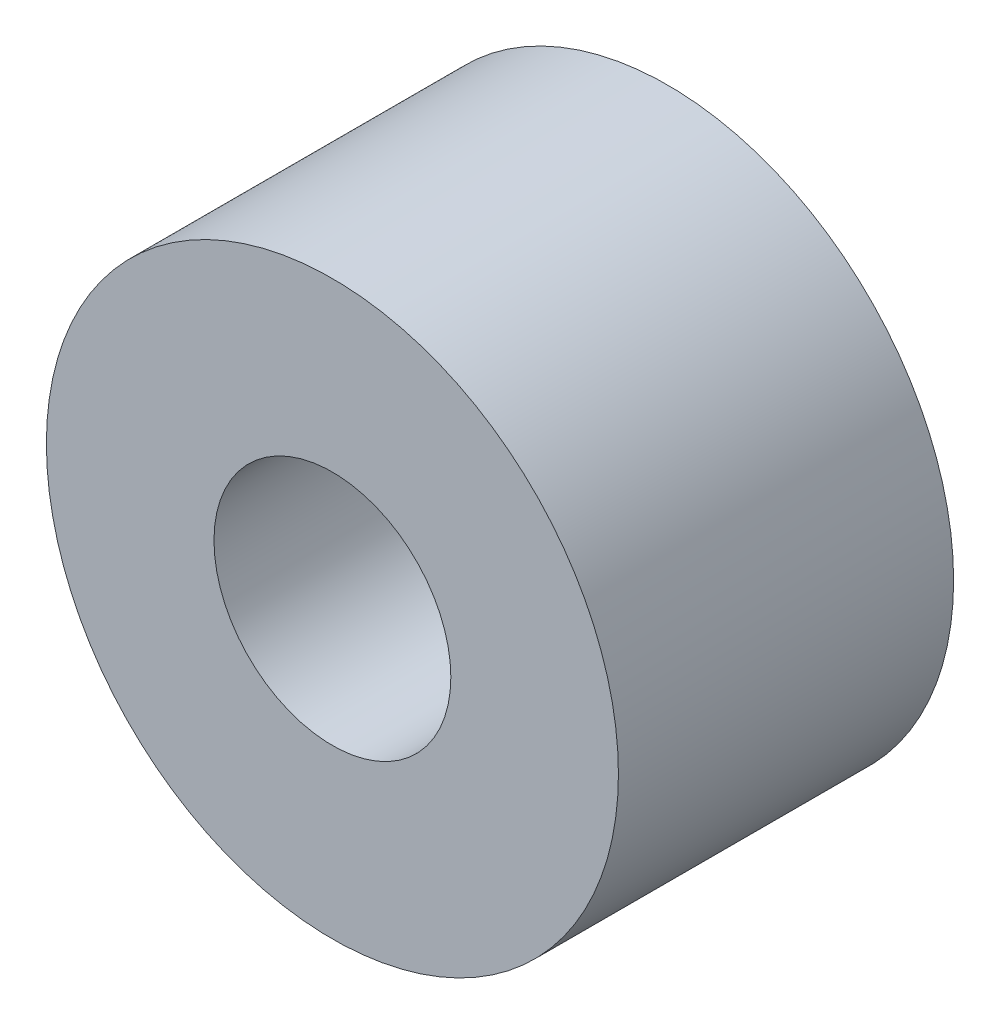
ISO-10303-21;
HEADER;
FILE_DESCRIPTION(('STEP AP214'),'2;1');
FILE_NAME('part.step','',(''),(''),'','','');
FILE_SCHEMA(('AUTOMOTIVE_DESIGN { 1 0 10303 214 1 1 1 1 }'));
ENDSEC;
DATA;
#1=APPLICATION_CONTEXT('core data for automotive mechanical design processes');
#2=APPLICATION_PROTOCOL_DEFINITION('international standard','automotive_design',2000,#1);
#3=PRODUCT_CONTEXT('',#1,'mechanical');
#4=PRODUCT('Part','Part','',(#3));
#5=PRODUCT_RELATED_PRODUCT_CATEGORY('part','',(#4));
#6=PRODUCT_DEFINITION_FORMATION('','',#4);
#7=PRODUCT_DEFINITION_CONTEXT('part definition',#1,'design');
#8=PRODUCT_DEFINITION('design','',#6,#7);
#9=PRODUCT_DEFINITION_SHAPE('','',#8);
#10=(LENGTH_UNIT() NAMED_UNIT(*) SI_UNIT(.MILLI.,.METRE.));
#11=(NAMED_UNIT(*) PLANE_ANGLE_UNIT() SI_UNIT($,.RADIAN.));
#12=(NAMED_UNIT(*) SI_UNIT($,.STERADIAN.) SOLID_ANGLE_UNIT());
#13=UNCERTAINTY_MEASURE_WITH_UNIT(LENGTH_MEASURE(1.E-05),#10,'distance_accuracy_value','');
#14=(GEOMETRIC_REPRESENTATION_CONTEXT(3) GLOBAL_UNCERTAINTY_ASSIGNED_CONTEXT((#13)) GLOBAL_UNIT_ASSIGNED_CONTEXT((#10,
#11,#12)) REPRESENTATION_CONTEXT('',''));
#15=CARTESIAN_POINT('',(0.,0.,0.));
#16=DIRECTION('',(0.,0.,1.));
#17=DIRECTION('',(1.,0.,0.));
#18=AXIS2_PLACEMENT_3D('',#15,#16,#17);
#19=CARTESIAN_POINT('',(-23.7395995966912,12.7425429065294,9.525));
#20=DIRECTION('',(0.,0.,1.));
#21=DIRECTION('',(1.,0.,0.));
#22=AXIS2_PLACEMENT_3D('',#19,#20,#21);
#23=PLANE('',#22);
#24=CARTESIAN_POINT('',(-23.7395995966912,12.7425429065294,9.525));
#25=DIRECTION('',(0.,0.,1.));
#26=DIRECTION('',(1.,0.,0.));
#27=AXIS2_PLACEMENT_3D('',#24,#25,#26);
#28=CIRCLE('',#27,8.128);
#29=CARTESIAN_POINT('',(-31.8675995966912,12.7425429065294,9.525));
#30=VERTEX_POINT('',#29);
#31=EDGE_CURVE('E10',#30,#30,#28,.T.);
#32=ORIENTED_EDGE('',*,*,#31,.T.);
#33=EDGE_LOOP('',(#32));
#34=FACE_BOUND('',#33,.T.);
#35=CARTESIAN_POINT('',(-23.7395995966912,12.7425429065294,9.525));
#36=DIRECTION('',(0.,0.,1.));
#37=DIRECTION('',(1.,0.,0.));
#38=AXIS2_PLACEMENT_3D('',#35,#36,#37);
#39=CIRCLE('',#38,3.3655);
#40=CARTESIAN_POINT('',(-27.1050995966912,12.7425429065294,9.525));
#41=VERTEX_POINT('',#40);
#42=EDGE_CURVE('E42',#41,#41,#39,.T.);
#43=ORIENTED_EDGE('',*,*,#42,.F.);
#44=EDGE_LOOP('',(#43));
#45=FACE_BOUND('',#44,.T.);
#46=ADVANCED_FACE('F31',(#34,#45),#23,.T.);
#47=CARTESIAN_POINT('',(-23.7395995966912,12.7425429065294,0.));
#48=DIRECTION('',(0.,0.,1.));
#49=DIRECTION('',(1.,0.,0.));
#50=AXIS2_PLACEMENT_3D('',#47,#48,#49);
#51=PLANE('',#50);
#52=CARTESIAN_POINT('',(-23.7395995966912,12.7425429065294,0.));
#53=DIRECTION('',(0.,0.,1.));
#54=DIRECTION('',(1.,0.,0.));
#55=AXIS2_PLACEMENT_3D('',#52,#53,#54);
#56=CIRCLE('',#55,8.128);
#57=CARTESIAN_POINT('',(-31.8675995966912,12.7425429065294,0.));
#58=VERTEX_POINT('',#57);
#59=EDGE_CURVE('E35',#58,#58,#56,.T.);
#60=ORIENTED_EDGE('',*,*,#59,.F.);
#61=EDGE_LOOP('',(#60));
#62=FACE_BOUND('',#61,.T.);
#63=CARTESIAN_POINT('',(-23.7395995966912,12.7425429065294,0.));
#64=DIRECTION('',(0.,0.,1.));
#65=DIRECTION('',(1.,0.,0.));
#66=AXIS2_PLACEMENT_3D('',#63,#64,#65);
#67=CIRCLE('',#66,3.3655);
#68=CARTESIAN_POINT('',(-27.1050995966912,12.7425429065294,0.));
#69=VERTEX_POINT('',#68);
#70=EDGE_CURVE('E44',#69,#69,#67,.T.);
#71=ORIENTED_EDGE('',*,*,#70,.T.);
#72=EDGE_LOOP('',(#71));
#73=FACE_BOUND('',#72,.T.);
#74=ADVANCED_FACE('F54',(#62,#73),#51,.F.);
#75=CARTESIAN_POINT('',(-23.7395995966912,12.7425429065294,9.525));
#76=DIRECTION('',(0.,0.,-1.));
#77=DIRECTION('',(-1.,0.,0.));
#78=AXIS2_PLACEMENT_3D('',#75,#76,#77);
#79=CYLINDRICAL_SURFACE('',#78,8.128);
#80=CARTESIAN_POINT('',(-31.8675995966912,12.7425429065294,9.525));
#81=CARTESIAN_POINT('',(-31.8675995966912,12.7425429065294,9.42578125));
#82=CARTESIAN_POINT('',(-31.8675995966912,12.7425429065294,9.3265625));
#83=CARTESIAN_POINT('',(-31.8675995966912,12.7425429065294,9.128125));
#84=CARTESIAN_POINT('',(-31.8675995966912,12.7425429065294,9.02890625));
#85=CARTESIAN_POINT('',(-31.8675995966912,12.7425429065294,8.83046875));
#86=CARTESIAN_POINT('',(-31.8675995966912,12.7425429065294,8.73125));
#87=CARTESIAN_POINT('',(-31.8675995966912,12.7425429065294,8.5328125));
#88=CARTESIAN_POINT('',(-31.8675995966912,12.7425429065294,8.43359375));
#89=CARTESIAN_POINT('',(-31.8675995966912,12.7425429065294,8.23515625));
#90=CARTESIAN_POINT('',(-31.8675995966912,12.7425429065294,8.1359375));
#91=CARTESIAN_POINT('',(-31.8675995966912,12.7425429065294,7.9375));
#92=CARTESIAN_POINT('',(-31.8675995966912,12.7425429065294,7.83828125));
#93=CARTESIAN_POINT('',(-31.8675995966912,12.7425429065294,7.63984375));
#94=CARTESIAN_POINT('',(-31.8675995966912,12.7425429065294,7.540625));
#95=CARTESIAN_POINT('',(-31.8675995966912,12.7425429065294,7.3421875));
#96=CARTESIAN_POINT('',(-31.8675995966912,12.7425429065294,7.24296875));
#97=CARTESIAN_POINT('',(-31.8675995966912,12.7425429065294,7.04453125));
#98=CARTESIAN_POINT('',(-31.8675995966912,12.7425429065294,6.9453125));
#99=CARTESIAN_POINT('',(-31.8675995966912,12.7425429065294,6.746875));
#100=CARTESIAN_POINT('',(-31.8675995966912,12.7425429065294,6.64765625));
#101=CARTESIAN_POINT('',(-31.8675995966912,12.7425429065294,6.44921875));
#102=CARTESIAN_POINT('',(-31.8675995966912,12.7425429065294,6.35));
#103=CARTESIAN_POINT('',(-31.8675995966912,12.7425429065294,6.1515625));
#104=CARTESIAN_POINT('',(-31.8675995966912,12.7425429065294,6.05234375));
#105=CARTESIAN_POINT('',(-31.8675995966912,12.7425429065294,5.85390625));
#106=CARTESIAN_POINT('',(-31.8675995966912,12.7425429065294,5.7546875));
#107=CARTESIAN_POINT('',(-31.8675995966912,12.7425429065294,5.55625));
#108=CARTESIAN_POINT('',(-31.8675995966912,12.7425429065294,5.45703125));
#109=CARTESIAN_POINT('',(-31.8675995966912,12.7425429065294,5.25859375));
#110=CARTESIAN_POINT('',(-31.8675995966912,12.7425429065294,5.159375));
#111=CARTESIAN_POINT('',(-31.8675995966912,12.7425429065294,4.9609375));
#112=CARTESIAN_POINT('',(-31.8675995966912,12.7425429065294,4.86171875));
#113=CARTESIAN_POINT('',(-31.8675995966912,12.7425429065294,4.66328125));
#114=CARTESIAN_POINT('',(-31.8675995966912,12.7425429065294,4.5640625));
#115=CARTESIAN_POINT('',(-31.8675995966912,12.7425429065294,4.365625));
#116=CARTESIAN_POINT('',(-31.8675995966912,12.7425429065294,4.26640625));
#117=CARTESIAN_POINT('',(-31.8675995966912,12.7425429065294,4.06796875));
#118=CARTESIAN_POINT('',(-31.8675995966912,12.7425429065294,3.96875));
#119=CARTESIAN_POINT('',(-31.8675995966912,12.7425429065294,3.7703125));
#120=CARTESIAN_POINT('',(-31.8675995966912,12.7425429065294,3.67109375));
#121=CARTESIAN_POINT('',(-31.8675995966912,12.7425429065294,3.47265625));
#122=CARTESIAN_POINT('',(-31.8675995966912,12.7425429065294,3.3734375));
#123=CARTESIAN_POINT('',(-31.8675995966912,12.7425429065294,3.175));
#124=CARTESIAN_POINT('',(-31.8675995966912,12.7425429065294,3.07578125));
#125=CARTESIAN_POINT('',(-31.8675995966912,12.7425429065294,2.87734375));
#126=CARTESIAN_POINT('',(-31.8675995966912,12.7425429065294,2.778125));
#127=CARTESIAN_POINT('',(-31.8675995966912,12.7425429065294,2.5796875));
#128=CARTESIAN_POINT('',(-31.8675995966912,12.7425429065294,2.48046875));
#129=CARTESIAN_POINT('',(-31.8675995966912,12.7425429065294,2.28203125));
#130=CARTESIAN_POINT('',(-31.8675995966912,12.7425429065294,2.1828125));
#131=CARTESIAN_POINT('',(-31.8675995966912,12.7425429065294,1.984375));
#132=CARTESIAN_POINT('',(-31.8675995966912,12.7425429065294,1.88515625));
#133=CARTESIAN_POINT('',(-31.8675995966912,12.7425429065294,1.68671875));
#134=CARTESIAN_POINT('',(-31.8675995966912,12.7425429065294,1.5875));
#135=CARTESIAN_POINT('',(-31.8675995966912,12.7425429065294,1.3890625));
#136=CARTESIAN_POINT('',(-31.8675995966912,12.7425429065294,1.28984375));
#137=CARTESIAN_POINT('',(-31.8675995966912,12.7425429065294,1.09140625));
#138=CARTESIAN_POINT('',(-31.8675995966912,12.7425429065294,0.992187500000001));
#139=CARTESIAN_POINT('',(-31.8675995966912,12.7425429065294,0.793750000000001));
#140=CARTESIAN_POINT('',(-31.8675995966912,12.7425429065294,0.69453125));
#141=CARTESIAN_POINT('',(-31.8675995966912,12.7425429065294,0.49609375));
#142=CARTESIAN_POINT('',(-31.8675995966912,12.7425429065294,0.396875));
#143=CARTESIAN_POINT('',(-31.8675995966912,12.7425429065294,0.1984375));
#144=CARTESIAN_POINT('',(-31.8675995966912,12.7425429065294,0.0992187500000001));
#145=CARTESIAN_POINT('',(-31.8675995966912,12.7425429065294,0.));
#146=B_SPLINE_CURVE_WITH_KNOTS('',3,(#80,#81,#82,#83,#84,#85,#86,#87,#88,#89,#90,#91,#92,#93,
#94,#95,#96,#97,#98,#99,#100,#101,#102,#103,#104,#105,#106,#107,#108,#109,#110,#111,#112,#113,
#114,#115,#116,#117,#118,#119,#120,#121,#122,#123,#124,#125,#126,#127,#128,#129,#130,#131,#132,
#133,#134,#135,#136,#137,#138,#139,#140,#141,#142,#143,#144,#145),.UNSPECIFIED.,.F.,.F.,(4,2,2,
2,2,2,2,2,2,2,2,2,2,2,2,2,2,2,2,2,2,2,2,2,2,2,2,2,2,2,2,2,4),(0.,0.29765625,0.5953125,
0.892968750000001,1.190625,1.48828125,1.7859375,2.08359375,2.38125,2.67890625,2.9765625,
3.27421875,3.571875,3.86953125,4.1671875,4.46484375,4.7625,5.06015625,5.3578125,5.65546875,
5.953125,6.25078125,6.5484375,6.84609375,7.14375,7.44140625,7.7390625,8.03671875,8.334375,
8.63203125,8.9296875,9.22734375,9.525),.UNSPECIFIED.);
#147=EDGE_CURVE('BSEAM33',#30,#58,#146,.T.);
#148=ORIENTED_EDGE('',*,*,#31,.F.);
#149=ORIENTED_EDGE('',*,*,#59,.T.);
#150=ORIENTED_EDGE('',*,*,#147,.T.);
#151=ORIENTED_EDGE('',*,*,#147,.F.);
#152=EDGE_LOOP('',(#148,#150,#149,#151));
#153=FACE_BOUND('',#152,.T.);
#154=ADVANCED_FACE('F33',(#153),#79,.T.);
#155=CARTESIAN_POINT('',(-23.7395995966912,12.7425429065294,9.525));
#156=DIRECTION('',(0.,0.,-1.));
#157=DIRECTION('',(-1.,0.,0.));
#158=AXIS2_PLACEMENT_3D('',#155,#156,#157);
#159=CYLINDRICAL_SURFACE('',#158,3.3655);
#160=CARTESIAN_POINT('',(-27.1050995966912,12.7425429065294,9.525));
#161=CARTESIAN_POINT('',(-27.1050995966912,12.7425429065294,9.42578125));
#162=CARTESIAN_POINT('',(-27.1050995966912,12.7425429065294,9.3265625));
#163=CARTESIAN_POINT('',(-27.1050995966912,12.7425429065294,9.128125));
#164=CARTESIAN_POINT('',(-27.1050995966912,12.7425429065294,9.02890625));
#165=CARTESIAN_POINT('',(-27.1050995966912,12.7425429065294,8.83046875));
#166=CARTESIAN_POINT('',(-27.1050995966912,12.7425429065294,8.73125));
#167=CARTESIAN_POINT('',(-27.1050995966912,12.7425429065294,8.5328125));
#168=CARTESIAN_POINT('',(-27.1050995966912,12.7425429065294,8.43359375));
#169=CARTESIAN_POINT('',(-27.1050995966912,12.7425429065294,8.23515625));
#170=CARTESIAN_POINT('',(-27.1050995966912,12.7425429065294,8.1359375));
#171=CARTESIAN_POINT('',(-27.1050995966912,12.7425429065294,7.9375));
#172=CARTESIAN_POINT('',(-27.1050995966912,12.7425429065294,7.83828125));
#173=CARTESIAN_POINT('',(-27.1050995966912,12.7425429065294,7.63984375));
#174=CARTESIAN_POINT('',(-27.1050995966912,12.7425429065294,7.540625));
#175=CARTESIAN_POINT('',(-27.1050995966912,12.7425429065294,7.3421875));
#176=CARTESIAN_POINT('',(-27.1050995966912,12.7425429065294,7.24296875));
#177=CARTESIAN_POINT('',(-27.1050995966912,12.7425429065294,7.04453125));
#178=CARTESIAN_POINT('',(-27.1050995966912,12.7425429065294,6.9453125));
#179=CARTESIAN_POINT('',(-27.1050995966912,12.7425429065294,6.746875));
#180=CARTESIAN_POINT('',(-27.1050995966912,12.7425429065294,6.64765625));
#181=CARTESIAN_POINT('',(-27.1050995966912,12.7425429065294,6.44921875));
#182=CARTESIAN_POINT('',(-27.1050995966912,12.7425429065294,6.35));
#183=CARTESIAN_POINT('',(-27.1050995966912,12.7425429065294,6.1515625));
#184=CARTESIAN_POINT('',(-27.1050995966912,12.7425429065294,6.05234375));
#185=CARTESIAN_POINT('',(-27.1050995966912,12.7425429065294,5.85390625));
#186=CARTESIAN_POINT('',(-27.1050995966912,12.7425429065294,5.7546875));
#187=CARTESIAN_POINT('',(-27.1050995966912,12.7425429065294,5.55625));
#188=CARTESIAN_POINT('',(-27.1050995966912,12.7425429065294,5.45703125));
#189=CARTESIAN_POINT('',(-27.1050995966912,12.7425429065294,5.25859375));
#190=CARTESIAN_POINT('',(-27.1050995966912,12.7425429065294,5.159375));
#191=CARTESIAN_POINT('',(-27.1050995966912,12.7425429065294,4.9609375));
#192=CARTESIAN_POINT('',(-27.1050995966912,12.7425429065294,4.86171875));
#193=CARTESIAN_POINT('',(-27.1050995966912,12.7425429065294,4.66328125));
#194=CARTESIAN_POINT('',(-27.1050995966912,12.7425429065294,4.5640625));
#195=CARTESIAN_POINT('',(-27.1050995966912,12.7425429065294,4.365625));
#196=CARTESIAN_POINT('',(-27.1050995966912,12.7425429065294,4.26640625));
#197=CARTESIAN_POINT('',(-27.1050995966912,12.7425429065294,4.06796875));
#198=CARTESIAN_POINT('',(-27.1050995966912,12.7425429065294,3.96875));
#199=CARTESIAN_POINT('',(-27.1050995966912,12.7425429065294,3.7703125));
#200=CARTESIAN_POINT('',(-27.1050995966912,12.7425429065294,3.67109375));
#201=CARTESIAN_POINT('',(-27.1050995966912,12.7425429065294,3.47265625));
#202=CARTESIAN_POINT('',(-27.1050995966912,12.7425429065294,3.3734375));
#203=CARTESIAN_POINT('',(-27.1050995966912,12.7425429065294,3.175));
#204=CARTESIAN_POINT('',(-27.1050995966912,12.7425429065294,3.07578125));
#205=CARTESIAN_POINT('',(-27.1050995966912,12.7425429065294,2.87734375));
#206=CARTESIAN_POINT('',(-27.1050995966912,12.7425429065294,2.778125));
#207=CARTESIAN_POINT('',(-27.1050995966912,12.7425429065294,2.5796875));
#208=CARTESIAN_POINT('',(-27.1050995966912,12.7425429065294,2.48046875));
#209=CARTESIAN_POINT('',(-27.1050995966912,12.7425429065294,2.28203125));
#210=CARTESIAN_POINT('',(-27.1050995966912,12.7425429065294,2.1828125));
#211=CARTESIAN_POINT('',(-27.1050995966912,12.7425429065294,1.984375));
#212=CARTESIAN_POINT('',(-27.1050995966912,12.7425429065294,1.88515625));
#213=CARTESIAN_POINT('',(-27.1050995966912,12.7425429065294,1.68671875));
#214=CARTESIAN_POINT('',(-27.1050995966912,12.7425429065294,1.5875));
#215=CARTESIAN_POINT('',(-27.1050995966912,12.7425429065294,1.3890625));
#216=CARTESIAN_POINT('',(-27.1050995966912,12.7425429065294,1.28984375));
#217=CARTESIAN_POINT('',(-27.1050995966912,12.7425429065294,1.09140625));
#218=CARTESIAN_POINT('',(-27.1050995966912,12.7425429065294,0.992187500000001));
#219=CARTESIAN_POINT('',(-27.1050995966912,12.7425429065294,0.793750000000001));
#220=CARTESIAN_POINT('',(-27.1050995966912,12.7425429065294,0.69453125));
#221=CARTESIAN_POINT('',(-27.1050995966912,12.7425429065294,0.49609375));
#222=CARTESIAN_POINT('',(-27.1050995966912,12.7425429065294,0.396875));
#223=CARTESIAN_POINT('',(-27.1050995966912,12.7425429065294,0.1984375));
#224=CARTESIAN_POINT('',(-27.1050995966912,12.7425429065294,0.0992187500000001));
#225=CARTESIAN_POINT('',(-27.1050995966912,12.7425429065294,0.));
#226=B_SPLINE_CURVE_WITH_KNOTS('',3,(#160,#161,#162,#163,#164,#165,#166,#167,#168,#169,#170,
#171,#172,#173,#174,#175,#176,#177,#178,#179,#180,#181,#182,#183,#184,#185,#186,#187,#188,#189,
#190,#191,#192,#193,#194,#195,#196,#197,#198,#199,#200,#201,#202,#203,#204,#205,#206,#207,#208,
#209,#210,#211,#212,#213,#214,#215,#216,#217,#218,#219,#220,#221,#222,#223,#224,#225),
.UNSPECIFIED.,.F.,.F.,(4,2,2,2,2,2,2,2,2,2,2,2,2,2,2,2,2,2,2,2,2,2,2,2,2,2,2,2,2,2,2,2,4),(0.,
0.29765625,0.5953125,0.892968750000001,1.190625,1.48828125,1.7859375,2.08359375,2.38125,
2.67890625,2.9765625,3.27421875,3.571875,3.86953125,4.1671875,4.46484375,4.7625,5.06015625,
5.3578125,5.65546875,5.953125,6.25078125,6.5484375,6.84609375,7.14375,7.44140625,7.7390625,
8.03671875,8.334375,8.63203125,8.9296875,9.22734375,9.525),.UNSPECIFIED.);
#227=EDGE_CURVE('BSEAM50',#41,#69,#226,.T.);
#228=ORIENTED_EDGE('',*,*,#42,.T.);
#229=ORIENTED_EDGE('',*,*,#70,.F.);
#230=ORIENTED_EDGE('',*,*,#227,.T.);
#231=ORIENTED_EDGE('',*,*,#227,.F.);
#232=EDGE_LOOP('',(#228,#230,#229,#231));
#233=FACE_BOUND('',#232,.T.);
#234=ADVANCED_FACE('F50',(#233),#159,.F.);
#235=CLOSED_SHELL('',(#46,#74,#154,#234));
#236=MANIFOLD_SOLID_BREP('B2',#235);
#237=ADVANCED_BREP_SHAPE_REPRESENTATION('',(#18,#236),#14);
#238=SHAPE_DEFINITION_REPRESENTATION(#9,#237);
ENDSEC;
END-ISO-10303-21;
